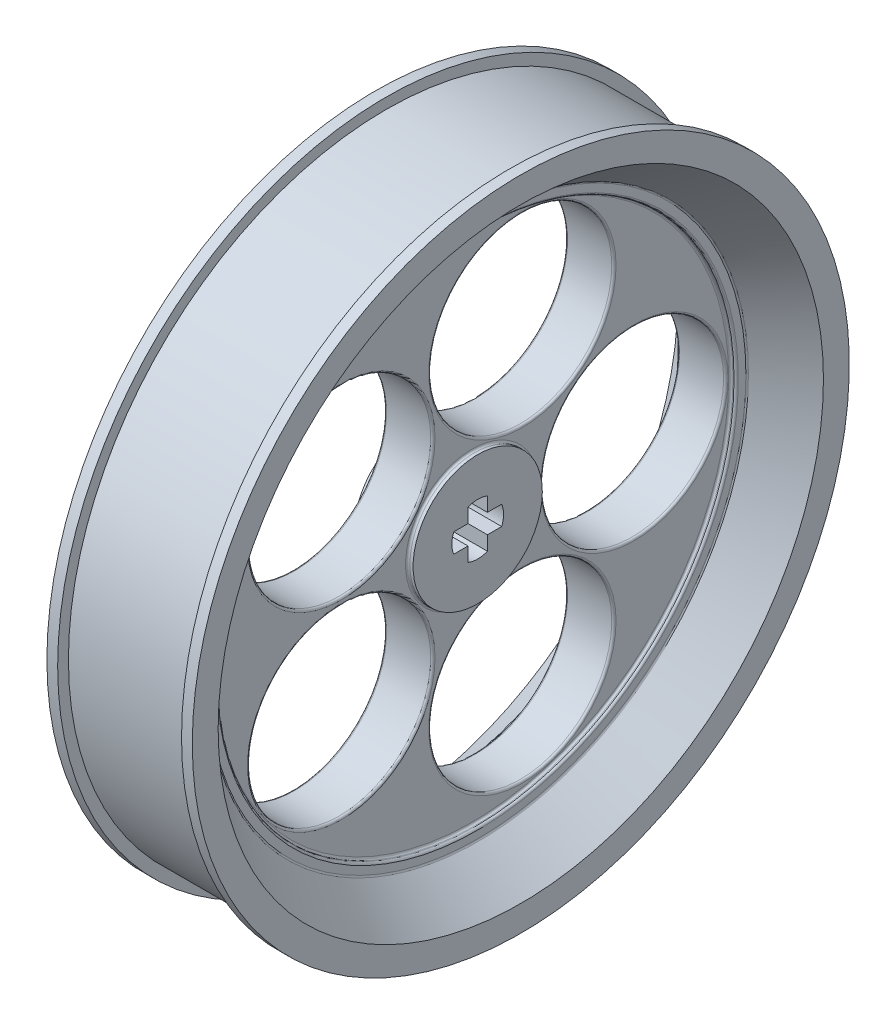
from build123d import *

# Parameters (mm, degrees)
CUT_EXTRUDE1_DEPTH = 45.167295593
SKETCH3_R          = 24
SKETCH3_R_2        = 6
CUT_EXTRUDE2_DEPTH = 0.5
CUT_EXTRUDE3_START = -0.5
SKETCH4_R          = 24
SKETCH4_R_2        = 6
CUT_EXTRUDE3_DEPTH = 0.5
SKETCH5_R          = 8.5
CUT_EXTRUDE5_DEPTH = 45.062455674
CIRPATTERN7_COUNT  = 5
FILLET1_R          = 0.2
FILLET2_R          = 0.2


with BuildPart() as part:
    # Sketch1 → Revolve1 (revolve)
    with BuildSketch(Plane.XY, mode=Mode.PRIVATE) as revolve1_sk:
        Polygon((-2.75, 0), (-2.75, 25), (-6.75, 28.1), (-6.75, 30.5), (-5.75, 30.5), (-5.75, 29.5), (5.75, 29.5), (5.75, 30.5), (6.75, 30.5), (6.75, 28.1), (2.75, 25), (2.75, 0), align=None)
    revolve(revolve1_sk.sketch.rotate(Axis((-106.362451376, 0, 0), (1, 0, 0)), 90), axis=Axis((-106.362451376, 0, 0), (1, 0, 0)))

    # Sketch2 → Cut-Extrude1 (cut, through all)
    with BuildSketch(Plane(origin=(2.75, 0, 0), x_dir=(0, 0, -1), z_dir=(1, 0, 0))):
        with BuildLine():
            Line((-2.224859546, 0.9), (-0.9, 0.9))
            Line((-0.9, 0.9), (-0.9, 2.224859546))
            ThreePointArc((-0.9, 2.224859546), (0, 2.4), (0.9, 2.224859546))
            Line((0.9, 2.224859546), (0.9, 0.9))
            Line((0.9, 0.9), (2.224859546, 0.9))
            ThreePointArc((2.224859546, 0.9), (2.4, 0), (2.224859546, -0.9))
            Line((2.224859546, -0.9), (0.9, -0.9))
            Line((0.9, -0.9), (0.9, -2.224859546))
            ThreePointArc((0.9, -2.224859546), (0, -2.4), (-0.9, -2.224859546))
            Line((-0.9, -2.224859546), (-0.9, -0.9))
            Line((-0.9, -0.9), (-2.224859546, -0.9))
            ThreePointArc((-2.224859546, -0.9), (-2.4, 0), (-2.224859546, 0.9))
        make_face()
    extrude(amount=-CUT_EXTRUDE1_DEPTH, mode=Mode.SUBTRACT)

    # Sketch3 → Cut-Extrude2 (cut)
    with BuildSketch(Plane.ZY.offset(2.75)):
        Circle(SKETCH3_R)
        Circle(SKETCH3_R_2, mode=Mode.SUBTRACT)
    extrude(amount=-CUT_EXTRUDE2_DEPTH, mode=Mode.SUBTRACT)

    # Sketch4 → Cut-Extrude3 (cut)
    with BuildSketch(Plane(origin=(2.75, 0, 0), x_dir=(0, 0, -1), z_dir=(1, 0, 0)).offset(CUT_EXTRUDE3_START)):
        with Locations(Location((0, 0, 0), (0, 0, 180))):
            Circle(SKETCH4_R)
        with Locations(Location((0, 0, 0), (0, 0, 180))):
            Circle(SKETCH4_R_2, mode=Mode.SUBTRACT)
    extrude(amount=CUT_EXTRUDE3_DEPTH, mode=Mode.SUBTRACT)

    # Sketch5 → Cut-Extrude5 (cut, through all)
    with BuildSketch(Plane(origin=(2.25, 0, 0), x_dir=(0, 0, -1), z_dir=(1, 0, 0))):
        with Locations((15.033877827, 0)):
            Circle(SKETCH5_R)
    cut_extrude5 = extrude(amount=-CUT_EXTRUDE5_DEPTH, mode=Mode.SUBTRACT)

    # CirPattern7: Cut-Extrude5 ×5 about axis
    cirpattern7_axis = Axis((0, 0, 0), (1, 0, 0))
    for i in range(1, CIRPATTERN7_COUNT):
        add(cut_extrude5.rotate(cirpattern7_axis, i * 360 / CIRPATTERN7_COUNT), mode=Mode.SUBTRACT)

    # Fillet1
    fillet1_edges = [part.edges().sort_by_distance(p)[0] for p in [
        (2.25, 0, -24),
        (2.75, 0, -24),
        (2.75, 0, -25),
    ]]
    fillet(fillet1_edges, radius=FILLET1_R)

    # Fillet2
    fillet2_edges = [part.edges().sort_by_distance(p)[0] for p in [
        (-2.25, -3.840517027, 5.286018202),
        (2.25, -3.840517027, 5.286018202),
        (-2.25, -6.214087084, -2.019079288),
        (2.25, -6.214087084, -2.019079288),
        (-2.75, 0, -25),
        (-2.25, 0, -24),
        (-2.75, 0, -24),
        (2.25, 0, -6),
        (-2.25, 0, -6.533877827),
        (2.25, 0, -6.533877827),
        (-2.25, 6.214087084, -2.019079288),
        (2.25, 6.214087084, -2.019079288),
        (-2.25, 3.840517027, 5.286018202),
        (2.25, 3.840517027, 5.286018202),
    ]]
    fillet(fillet2_edges, radius=FILLET2_R)


solid = part.part
